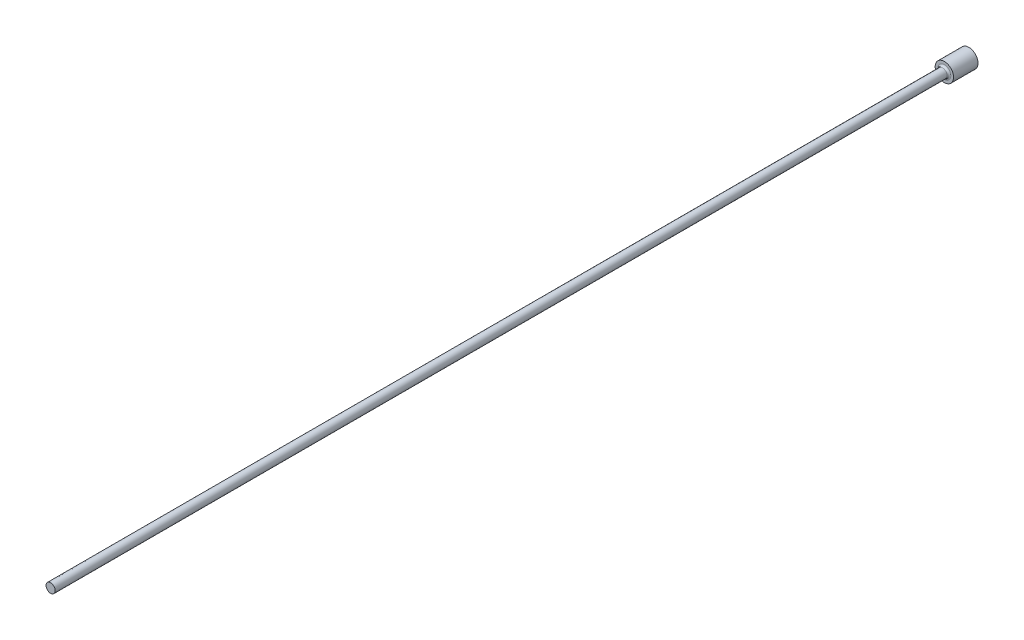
from build123d import *

# Parameters (mm, degrees)
FILLET1_R = 0.3


with BuildPart() as part:
    # FV → Revolve1 (revolve)
    with BuildSketch(Plane(origin=(0, 0, 0), x_dir=(1, 0, 0), z_dir=(0, 1, 0)), mode=Mode.PRIVATE) as revolve1_sk:
        Polygon((0, 0), (1.5, 0), (1.5, -4), (0.75, -4), (0.75, -150), (0, -150), align=None)
    revolve(revolve1_sk.sketch.rotate(Axis((0, 0, -9.033228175), (0, 0, 1)), 180), axis=Axis((0, 0, -9.033228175), (0, 0, 1)))

    # Fillet1
    fillet1_edges = [part.edges().sort_by_distance(p)[0] for p in [
        (0.75, 0, 4),
    ]]
    fillet(fillet1_edges, radius=FILLET1_R)


solid = part.part
